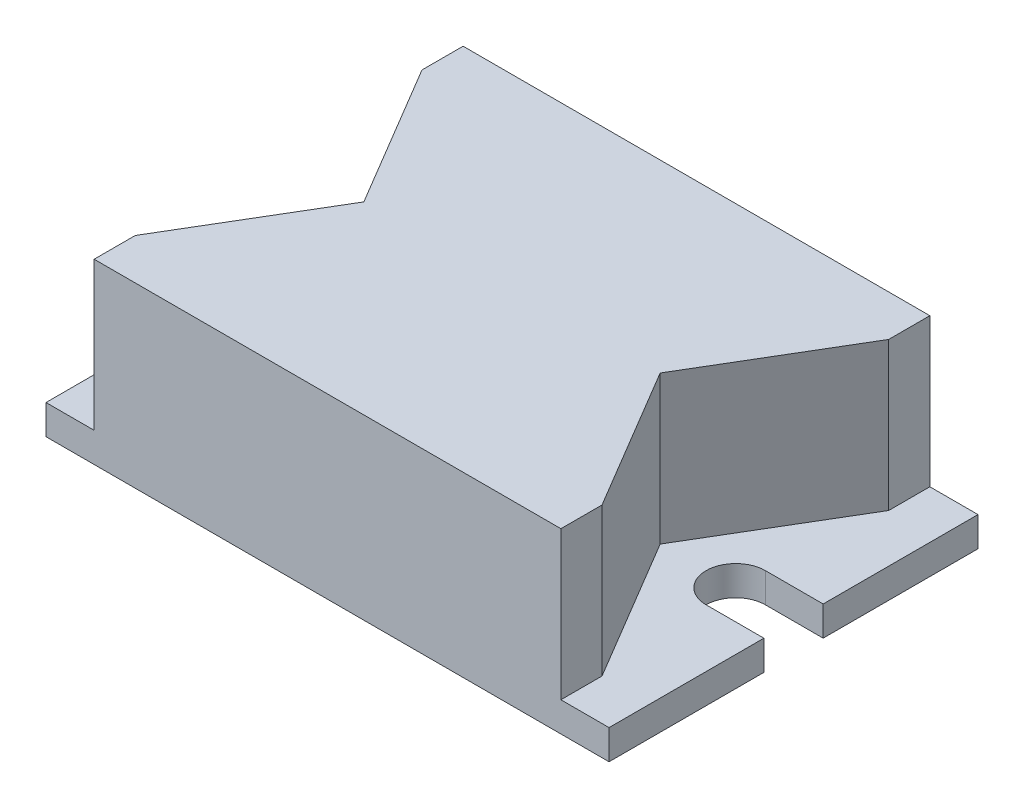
ISO-10303-21;
HEADER;
FILE_DESCRIPTION(('STEP AP214'),'2;1');
FILE_NAME('part.step','',(''),(''),'','','');
FILE_SCHEMA(('AUTOMOTIVE_DESIGN { 1 0 10303 214 1 1 1 1 }'));
ENDSEC;
DATA;
#1=APPLICATION_CONTEXT('core data for automotive mechanical design processes');
#2=APPLICATION_PROTOCOL_DEFINITION('international standard','automotive_design',2000,#1);
#3=PRODUCT_CONTEXT('',#1,'mechanical');
#4=PRODUCT('Part','Part','',(#3));
#5=PRODUCT_RELATED_PRODUCT_CATEGORY('part','',(#4));
#6=PRODUCT_DEFINITION_FORMATION('','',#4);
#7=PRODUCT_DEFINITION_CONTEXT('part definition',#1,'design');
#8=PRODUCT_DEFINITION('design','',#6,#7);
#9=PRODUCT_DEFINITION_SHAPE('','',#8);
#10=(LENGTH_UNIT() NAMED_UNIT(*) SI_UNIT(.MILLI.,.METRE.));
#11=(NAMED_UNIT(*) PLANE_ANGLE_UNIT() SI_UNIT($,.RADIAN.));
#12=(NAMED_UNIT(*) SI_UNIT($,.STERADIAN.) SOLID_ANGLE_UNIT());
#13=UNCERTAINTY_MEASURE_WITH_UNIT(LENGTH_MEASURE(1.E-05),#10,'distance_accuracy_value','');
#14=(GEOMETRIC_REPRESENTATION_CONTEXT(3) GLOBAL_UNCERTAINTY_ASSIGNED_CONTEXT((#13)) GLOBAL_UNIT_ASSIGNED_CONTEXT((#10,
#11,#12)) REPRESENTATION_CONTEXT('',''));
#15=CARTESIAN_POINT('',(0.,0.,0.));
#16=DIRECTION('',(0.,0.,1.));
#17=DIRECTION('',(1.,0.,0.));
#18=AXIS2_PLACEMENT_3D('',#15,#16,#17);
#19=CARTESIAN_POINT('',(0.,2.,0.));
#20=DIRECTION('',(0.,1.,0.));
#21=DIRECTION('',(0.,0.,1.));
#22=AXIS2_PLACEMENT_3D('',#19,#20,#21);
#23=PLANE('',#22);
#24=CARTESIAN_POINT('',(-15.1,2.,0.));
#25=DIRECTION('',(0.,1.,0.));
#26=DIRECTION('',(0.,0.,1.));
#27=AXIS2_PLACEMENT_3D('',#24,#25,#26);
#28=CIRCLE('',#27,2.);
#29=CARTESIAN_POINT('',(-15.1,2.,2.));
#30=VERTEX_POINT('',#29);
#31=EDGE_CURVE('E306',#30,#30,#28,.T.);
#32=ORIENTED_EDGE('',*,*,#31,.F.);
#33=EDGE_LOOP('',(#32));
#34=FACE_BOUND('',#33,.T.);
#35=DIRECTION('',(-0.510907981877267,0.,-0.859635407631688));
#36=VECTOR('',#35,1.);
#37=CARTESIAN_POINT('',(-7.38973034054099,2.,4.39194591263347));
#38=LINE('',#37,#36);
#39=CARTESIAN_POINT('',(-10.,2.,0.));
#40=VERTEX_POINT('',#39);
#41=CARTESIAN_POINT('',(-15.75,2.,-9.67474333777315));
#42=VERTEX_POINT('',#41);
#43=EDGE_CURVE('E63',#40,#42,#38,.T.);
#44=ORIENTED_EDGE('',*,*,#43,.T.);
#45=DIRECTION('',(0.,0.,-1.));
#46=VECTOR('',#45,1.);
#47=CARTESIAN_POINT('',(-15.75,2.,0.));
#48=LINE('',#47,#46);
#49=CARTESIAN_POINT('',(-15.75,2.,-12.45));
#50=VERTEX_POINT('',#49);
#51=EDGE_CURVE('E274',#42,#50,#48,.T.);
#52=ORIENTED_EDGE('',*,*,#51,.T.);
#53=DIRECTION('',(1.,0.,0.));
#54=VECTOR('',#53,1.);
#55=CARTESIAN_POINT('',(0.,2.,-12.45));
#56=LINE('',#55,#54);
#57=CARTESIAN_POINT('',(-19.,2.,-12.45));
#58=VERTEX_POINT('',#57);
#59=EDGE_CURVE('E280',#58,#50,#56,.T.);
#60=ORIENTED_EDGE('',*,*,#59,.F.);
#61=DIRECTION('',(0.,0.,1.));
#62=VECTOR('',#61,1.);
#63=CARTESIAN_POINT('',(-19.,2.,0.));
#64=LINE('',#63,#62);
#65=CARTESIAN_POINT('',(-19.,2.,12.45));
#66=VERTEX_POINT('',#65);
#67=EDGE_CURVE('E283',#58,#66,#64,.T.);
#68=ORIENTED_EDGE('',*,*,#67,.T.);
#69=DIRECTION('',(1.,0.,0.));
#70=VECTOR('',#69,1.);
#71=CARTESIAN_POINT('',(0.,2.,12.45));
#72=LINE('',#71,#70);
#73=CARTESIAN_POINT('',(-15.75,2.,12.45));
#74=VERTEX_POINT('',#73);
#75=EDGE_CURVE('E288',#66,#74,#72,.T.);
#76=ORIENTED_EDGE('',*,*,#75,.T.);
#77=DIRECTION('',(0.,0.,1.));
#78=VECTOR('',#77,1.);
#79=CARTESIAN_POINT('',(-15.75,2.,0.));
#80=LINE('',#79,#78);
#81=CARTESIAN_POINT('',(-15.75,2.,9.67474333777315));
#82=VERTEX_POINT('',#81);
#83=EDGE_CURVE('E266',#82,#74,#80,.T.);
#84=ORIENTED_EDGE('',*,*,#83,.F.);
#85=DIRECTION('',(-0.510907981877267,0.,0.859635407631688));
#86=VECTOR('',#85,1.);
#87=CARTESIAN_POINT('',(-7.38973034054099,2.,-4.39194591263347));
#88=LINE('',#87,#86);
#89=EDGE_CURVE('E68',#40,#82,#88,.T.);
#90=ORIENTED_EDGE('',*,*,#89,.F.);
#91=EDGE_LOOP('',(#44,#52,#60,#68,#76,#84,#90));
#92=FACE_BOUND('',#91,.T.);
#93=ADVANCED_FACE('F47',(#34,#92),#23,.T.);
#94=CARTESIAN_POINT('',(0.,2.,-12.45));
#95=DIRECTION('',(0.,0.,-1.));
#96=DIRECTION('',(-1.,0.,0.));
#97=AXIS2_PLACEMENT_3D('',#94,#95,#96);
#98=PLANE('',#97);
#99=DIRECTION('',(0.,-1.,0.));
#100=VECTOR('',#99,1.);
#101=CARTESIAN_POINT('',(19.,2.,-12.45));
#102=LINE('',#101,#100);
#103=CARTESIAN_POINT('',(19.,2.,-12.45));
#104=VERTEX_POINT('',#103);
#105=CARTESIAN_POINT('',(19.,0.,-12.45));
#106=VERTEX_POINT('',#105);
#107=EDGE_CURVE('E310',#104,#106,#102,.T.);
#108=ORIENTED_EDGE('',*,*,#107,.T.);
#109=DIRECTION('',(1.,0.,0.));
#110=VECTOR('',#109,1.);
#111=CARTESIAN_POINT('',(0.,0.,-12.45));
#112=LINE('',#111,#110);
#113=CARTESIAN_POINT('',(-19.,0.,-12.45));
#114=VERTEX_POINT('',#113);
#115=EDGE_CURVE('E279',#114,#106,#112,.T.);
#116=ORIENTED_EDGE('',*,*,#115,.F.);
#117=DIRECTION('',(0.,-1.,0.));
#118=VECTOR('',#117,1.);
#119=CARTESIAN_POINT('',(-19.,2.,-12.45));
#120=LINE('',#119,#118);
#121=EDGE_CURVE('E11',#58,#114,#120,.T.);
#122=ORIENTED_EDGE('',*,*,#121,.F.);
#123=ORIENTED_EDGE('',*,*,#59,.T.);
#124=DIRECTION('',(0.,-1.,0.));
#125=VECTOR('',#124,1.);
#126=CARTESIAN_POINT('',(-15.75,12.,-12.45));
#127=LINE('',#126,#125);
#128=CARTESIAN_POINT('',(-15.75,12.,-12.45));
#129=VERTEX_POINT('',#128);
#130=EDGE_CURVE('E182',#129,#50,#127,.T.);
#131=ORIENTED_EDGE('',*,*,#130,.F.);
#132=DIRECTION('',(1.,0.,0.));
#133=VECTOR('',#132,1.);
#134=CARTESIAN_POINT('',(0.,12.,-12.45));
#135=LINE('',#134,#133);
#136=CARTESIAN_POINT('',(15.75,12.,-12.45));
#137=VERTEX_POINT('',#136);
#138=EDGE_CURVE('E187',#129,#137,#135,.T.);
#139=ORIENTED_EDGE('',*,*,#138,.T.);
#140=DIRECTION('',(0.,-1.,0.));
#141=VECTOR('',#140,1.);
#142=CARTESIAN_POINT('',(15.75,12.,-12.45));
#143=LINE('',#142,#141);
#144=CARTESIAN_POINT('',(15.75,2.,-12.45));
#145=VERTEX_POINT('',#144);
#146=EDGE_CURVE('E171',#137,#145,#143,.T.);
#147=ORIENTED_EDGE('',*,*,#146,.T.);
#148=EDGE_CURVE('E284',#145,#104,#56,.T.);
#149=ORIENTED_EDGE('',*,*,#148,.T.);
#150=EDGE_LOOP('',(#108,#116,#122,#123,#131,#139,#147,#149));
#151=FACE_BOUND('',#150,.T.);
#152=ADVANCED_FACE('F49',(#151),#98,.T.);
#153=CARTESIAN_POINT('',(-19.,2.,0.));
#154=DIRECTION('',(1.,0.,0.));
#155=DIRECTION('',(0.,0.,-1.));
#156=AXIS2_PLACEMENT_3D('',#153,#154,#155);
#157=PLANE('',#156);
#158=DIRECTION('',(0.,0.,1.));
#159=VECTOR('',#158,1.);
#160=CARTESIAN_POINT('',(-19.,0.,0.));
#161=LINE('',#160,#159);
#162=CARTESIAN_POINT('',(-19.,0.,12.45));
#163=VERTEX_POINT('',#162);
#164=EDGE_CURVE('E313',#114,#163,#161,.T.);
#165=ORIENTED_EDGE('',*,*,#164,.T.);
#166=DIRECTION('',(0.,-1.,0.));
#167=VECTOR('',#166,1.);
#168=CARTESIAN_POINT('',(-19.,2.,12.45));
#169=LINE('',#168,#167);
#170=EDGE_CURVE('E56',#66,#163,#169,.T.);
#171=ORIENTED_EDGE('',*,*,#170,.F.);
#172=ORIENTED_EDGE('',*,*,#67,.F.);
#173=ORIENTED_EDGE('',*,*,#121,.T.);
#174=EDGE_LOOP('',(#165,#171,#172,#173));
#175=FACE_BOUND('',#174,.T.);
#176=ADVANCED_FACE('F404',(#175),#157,.F.);
#177=CARTESIAN_POINT('',(0.,2.,12.45));
#178=DIRECTION('',(0.,0.,-1.));
#179=DIRECTION('',(-1.,0.,0.));
#180=AXIS2_PLACEMENT_3D('',#177,#178,#179);
#181=PLANE('',#180);
#182=DIRECTION('',(1.,0.,0.));
#183=VECTOR('',#182,1.);
#184=CARTESIAN_POINT('',(0.,0.,12.45));
#185=LINE('',#184,#183);
#186=CARTESIAN_POINT('',(19.,0.,12.45));
#187=VERTEX_POINT('',#186);
#188=EDGE_CURVE('E316',#163,#187,#185,.T.);
#189=ORIENTED_EDGE('',*,*,#188,.T.);
#190=DIRECTION('',(0.,-1.,0.));
#191=VECTOR('',#190,1.);
#192=CARTESIAN_POINT('',(19.,2.,12.45));
#193=LINE('',#192,#191);
#194=CARTESIAN_POINT('',(19.,2.,12.45));
#195=VERTEX_POINT('',#194);
#196=EDGE_CURVE('E354',#195,#187,#193,.T.);
#197=ORIENTED_EDGE('',*,*,#196,.F.);
#198=CARTESIAN_POINT('',(15.75,2.,12.45));
#199=VERTEX_POINT('',#198);
#200=EDGE_CURVE('E287',#199,#195,#72,.T.);
#201=ORIENTED_EDGE('',*,*,#200,.F.);
#202=DIRECTION('',(0.,-1.,0.));
#203=VECTOR('',#202,1.);
#204=CARTESIAN_POINT('',(15.75,12.,12.45));
#205=LINE('',#204,#203);
#206=CARTESIAN_POINT('',(15.75,12.,12.45));
#207=VERTEX_POINT('',#206);
#208=EDGE_CURVE('E235',#207,#199,#205,.T.);
#209=ORIENTED_EDGE('',*,*,#208,.F.);
#210=DIRECTION('',(1.,0.,0.));
#211=VECTOR('',#210,1.);
#212=CARTESIAN_POINT('',(0.,12.,12.45));
#213=LINE('',#212,#211);
#214=CARTESIAN_POINT('',(-15.75,12.,12.45));
#215=VERTEX_POINT('',#214);
#216=EDGE_CURVE('E213',#215,#207,#213,.T.);
#217=ORIENTED_EDGE('',*,*,#216,.F.);
#218=DIRECTION('',(0.,-1.,0.));
#219=VECTOR('',#218,1.);
#220=CARTESIAN_POINT('',(-15.75,12.,12.45));
#221=LINE('',#220,#219);
#222=EDGE_CURVE('E239',#215,#74,#221,.T.);
#223=ORIENTED_EDGE('',*,*,#222,.T.);
#224=ORIENTED_EDGE('',*,*,#75,.F.);
#225=ORIENTED_EDGE('',*,*,#170,.T.);
#226=EDGE_LOOP('',(#189,#197,#201,#209,#217,#223,#224,#225));
#227=FACE_BOUND('',#226,.T.);
#228=ADVANCED_FACE('F363',(#227),#181,.F.);
#229=CARTESIAN_POINT('',(19.,2.,0.));
#230=DIRECTION('',(1.,0.,0.));
#231=DIRECTION('',(0.,0.,-1.));
#232=AXIS2_PLACEMENT_3D('',#229,#230,#231);
#233=PLANE('',#232);
#234=DIRECTION('',(0.,0.,1.));
#235=VECTOR('',#234,1.);
#236=CARTESIAN_POINT('',(19.,0.,0.));
#237=LINE('',#236,#235);
#238=CARTESIAN_POINT('',(19.,0.,2.));
#239=VERTEX_POINT('',#238);
#240=EDGE_CURVE('E319',#239,#187,#237,.T.);
#241=ORIENTED_EDGE('',*,*,#240,.F.);
#242=DIRECTION('',(0.,-1.,0.));
#243=VECTOR('',#242,1.);
#244=CARTESIAN_POINT('',(19.,2.,2.));
#245=LINE('',#244,#243);
#246=CARTESIAN_POINT('',(19.,2.,2.));
#247=VERTEX_POINT('',#246);
#248=EDGE_CURVE('E351',#247,#239,#245,.T.);
#249=ORIENTED_EDGE('',*,*,#248,.F.);
#250=DIRECTION('',(0.,0.,1.));
#251=VECTOR('',#250,1.);
#252=CARTESIAN_POINT('',(19.,2.,0.));
#253=LINE('',#252,#251);
#254=EDGE_CURVE('E291',#247,#195,#253,.T.);
#255=ORIENTED_EDGE('',*,*,#254,.T.);
#256=ORIENTED_EDGE('',*,*,#196,.T.);
#257=EDGE_LOOP('',(#241,#249,#255,#256));
#258=FACE_BOUND('',#257,.T.);
#259=ADVANCED_FACE('F376',(#258),#233,.T.);
#260=CARTESIAN_POINT('',(0.,2.,2.));
#261=DIRECTION('',(0.,0.,-1.));
#262=DIRECTION('',(-1.,0.,0.));
#263=AXIS2_PLACEMENT_3D('',#260,#261,#262);
#264=PLANE('',#263);
#265=DIRECTION('',(1.,0.,0.));
#266=VECTOR('',#265,1.);
#267=CARTESIAN_POINT('',(0.,0.,2.));
#268=LINE('',#267,#266);
#269=CARTESIAN_POINT('',(15.1,0.,2.));
#270=VERTEX_POINT('',#269);
#271=EDGE_CURVE('E323',#270,#239,#268,.T.);
#272=ORIENTED_EDGE('',*,*,#271,.F.);
#273=DIRECTION('',(0.,-1.,0.));
#274=VECTOR('',#273,1.);
#275=CARTESIAN_POINT('',(15.1,2.,2.));
#276=LINE('',#275,#274);
#277=CARTESIAN_POINT('',(15.1,2.,2.));
#278=VERTEX_POINT('',#277);
#279=EDGE_CURVE('E348',#278,#270,#276,.T.);
#280=ORIENTED_EDGE('',*,*,#279,.F.);
#281=DIRECTION('',(1.,0.,0.));
#282=VECTOR('',#281,1.);
#283=CARTESIAN_POINT('',(0.,2.,2.));
#284=LINE('',#283,#282);
#285=EDGE_CURVE('E295',#278,#247,#284,.T.);
#286=ORIENTED_EDGE('',*,*,#285,.T.);
#287=ORIENTED_EDGE('',*,*,#248,.T.);
#288=EDGE_LOOP('',(#272,#280,#286,#287));
#289=FACE_BOUND('',#288,.T.);
#290=ADVANCED_FACE('F556',(#289),#264,.T.);
#291=CARTESIAN_POINT('',(15.1,2.,0.));
#292=DIRECTION('',(0.,-1.,0.));
#293=DIRECTION('',(0.,0.,-1.));
#294=AXIS2_PLACEMENT_3D('',#291,#292,#293);
#295=CYLINDRICAL_SURFACE('',#294,2.);
#296=CARTESIAN_POINT('',(15.1,0.,0.));
#297=DIRECTION('',(0.,1.,0.));
#298=DIRECTION('',(0.,0.,1.));
#299=AXIS2_PLACEMENT_3D('',#296,#297,#298);
#300=CIRCLE('',#299,2.);
#301=CARTESIAN_POINT('',(15.1,0.,-2.));
#302=VERTEX_POINT('',#301);
#303=EDGE_CURVE('E328',#270,#302,#300,.F.);
#304=ORIENTED_EDGE('',*,*,#303,.T.);
#305=DIRECTION('',(0.,-1.,0.));
#306=VECTOR('',#305,1.);
#307=CARTESIAN_POINT('',(15.1,2.,-2.));
#308=LINE('',#307,#306);
#309=CARTESIAN_POINT('',(15.1,2.,-2.));
#310=VERTEX_POINT('',#309);
#311=EDGE_CURVE('E344',#310,#302,#308,.T.);
#312=ORIENTED_EDGE('',*,*,#311,.F.);
#313=CARTESIAN_POINT('',(15.1,2.,0.));
#314=DIRECTION('',(0.,1.,0.));
#315=DIRECTION('',(0.,0.,1.));
#316=AXIS2_PLACEMENT_3D('',#313,#314,#315);
#317=CIRCLE('',#316,2.);
#318=EDGE_CURVE('E300',#278,#310,#317,.F.);
#319=ORIENTED_EDGE('',*,*,#318,.F.);
#320=ORIENTED_EDGE('',*,*,#279,.T.);
#321=EDGE_LOOP('',(#304,#312,#319,#320));
#322=FACE_BOUND('',#321,.T.);
#323=ADVANCED_FACE('F547',(#322),#295,.F.);
#324=CARTESIAN_POINT('',(0.,2.,-2.));
#325=DIRECTION('',(0.,0.,-1.));
#326=DIRECTION('',(-1.,0.,0.));
#327=AXIS2_PLACEMENT_3D('',#324,#325,#326);
#328=PLANE('',#327);
#329=DIRECTION('',(1.,0.,0.));
#330=VECTOR('',#329,1.);
#331=CARTESIAN_POINT('',(0.,0.,-2.));
#332=LINE('',#331,#330);
#333=CARTESIAN_POINT('',(19.,0.,-2.));
#334=VERTEX_POINT('',#333);
#335=EDGE_CURVE('E331',#302,#334,#332,.T.);
#336=ORIENTED_EDGE('',*,*,#335,.T.);
#337=DIRECTION('',(0.,-1.,0.));
#338=VECTOR('',#337,1.);
#339=CARTESIAN_POINT('',(19.,2.,-2.));
#340=LINE('',#339,#338);
#341=CARTESIAN_POINT('',(19.,2.,-2.));
#342=VERTEX_POINT('',#341);
#343=EDGE_CURVE('E341',#342,#334,#340,.T.);
#344=ORIENTED_EDGE('',*,*,#343,.F.);
#345=DIRECTION('',(1.,0.,0.));
#346=VECTOR('',#345,1.);
#347=CARTESIAN_POINT('',(0.,2.,-2.));
#348=LINE('',#347,#346);
#349=EDGE_CURVE('E303',#310,#342,#348,.T.);
#350=ORIENTED_EDGE('',*,*,#349,.F.);
#351=ORIENTED_EDGE('',*,*,#311,.T.);
#352=EDGE_LOOP('',(#336,#344,#350,#351));
#353=FACE_BOUND('',#352,.T.);
#354=ADVANCED_FACE('F538',(#353),#328,.F.);
#355=EDGE_CURVE('E324',#106,#334,#237,.T.);
#356=ORIENTED_EDGE('',*,*,#355,.F.);
#357=ORIENTED_EDGE('',*,*,#107,.F.);
#358=EDGE_CURVE('E296',#104,#342,#253,.T.);
#359=ORIENTED_EDGE('',*,*,#358,.T.);
#360=ORIENTED_EDGE('',*,*,#343,.T.);
#361=EDGE_LOOP('',(#356,#357,#359,#360));
#362=FACE_BOUND('',#361,.T.);
#363=ADVANCED_FACE('F427',(#362),#233,.T.);
#364=CARTESIAN_POINT('',(-15.1,2.,0.));
#365=DIRECTION('',(0.,-1.,0.));
#366=DIRECTION('',(0.,0.,-1.));
#367=AXIS2_PLACEMENT_3D('',#364,#365,#366);
#368=CYLINDRICAL_SURFACE('',#367,2.);
#369=ORIENTED_EDGE('',*,*,#31,.T.);
#370=EDGE_LOOP('',(#369));
#371=FACE_BOUND('',#370,.T.);
#372=CARTESIAN_POINT('',(-15.1,0.,0.));
#373=DIRECTION('',(0.,1.,0.));
#374=DIRECTION('',(0.,0.,1.));
#375=AXIS2_PLACEMENT_3D('',#372,#373,#374);
#376=CIRCLE('',#375,2.);
#377=CARTESIAN_POINT('',(-15.1,0.,2.));
#378=VERTEX_POINT('',#377);
#379=EDGE_CURVE('E335',#378,#378,#376,.T.);
#380=ORIENTED_EDGE('',*,*,#379,.F.);
#381=EDGE_LOOP('',(#380));
#382=FACE_BOUND('',#381,.T.);
#383=ADVANCED_FACE('F423',(#371,#382),#368,.F.);
#384=DIRECTION('',(0.,0.,-1.));
#385=VECTOR('',#384,1.);
#386=CARTESIAN_POINT('',(15.75,2.,0.));
#387=LINE('',#386,#385);
#388=CARTESIAN_POINT('',(15.75,2.,-9.67474333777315));
#389=VERTEX_POINT('',#388);
#390=EDGE_CURVE('E177',#389,#145,#387,.T.);
#391=ORIENTED_EDGE('',*,*,#390,.F.);
#392=DIRECTION('',(0.510907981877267,0.,-0.859635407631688));
#393=VECTOR('',#392,1.);
#394=CARTESIAN_POINT('',(7.38973034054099,2.,4.39194591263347));
#395=LINE('',#394,#393);
#396=CARTESIAN_POINT('',(10.,2.,0.));
#397=VERTEX_POINT('',#396);
#398=EDGE_CURVE('E181',#397,#389,#395,.T.);
#399=ORIENTED_EDGE('',*,*,#398,.F.);
#400=DIRECTION('',(0.510907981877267,0.,0.859635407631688));
#401=VECTOR('',#400,1.);
#402=CARTESIAN_POINT('',(7.38973034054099,2.,-4.39194591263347));
#403=LINE('',#402,#401);
#404=CARTESIAN_POINT('',(15.75,2.,9.67474333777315));
#405=VERTEX_POINT('',#404);
#406=EDGE_CURVE('E260',#397,#405,#403,.T.);
#407=ORIENTED_EDGE('',*,*,#406,.T.);
#408=DIRECTION('',(0.,0.,1.));
#409=VECTOR('',#408,1.);
#410=CARTESIAN_POINT('',(15.75,2.,0.));
#411=LINE('',#410,#409);
#412=EDGE_CURVE('E263',#405,#199,#411,.T.);
#413=ORIENTED_EDGE('',*,*,#412,.T.);
#414=ORIENTED_EDGE('',*,*,#200,.T.);
#415=ORIENTED_EDGE('',*,*,#254,.F.);
#416=ORIENTED_EDGE('',*,*,#285,.F.);
#417=ORIENTED_EDGE('',*,*,#318,.T.);
#418=ORIENTED_EDGE('',*,*,#349,.T.);
#419=ORIENTED_EDGE('',*,*,#358,.F.);
#420=ORIENTED_EDGE('',*,*,#148,.F.);
#421=EDGE_LOOP('',(#391,#399,#407,#413,#414,#415,#416,#417,#418,#419,#420));
#422=FACE_BOUND('',#421,.T.);
#423=ADVANCED_FACE('F415',(#422),#23,.T.);
#424=CARTESIAN_POINT('',(0.,0.,0.));
#425=DIRECTION('',(0.,1.,0.));
#426=DIRECTION('',(0.,0.,1.));
#427=AXIS2_PLACEMENT_3D('',#424,#425,#426);
#428=PLANE('',#427);
#429=ORIENTED_EDGE('',*,*,#115,.T.);
#430=ORIENTED_EDGE('',*,*,#355,.T.);
#431=ORIENTED_EDGE('',*,*,#335,.F.);
#432=ORIENTED_EDGE('',*,*,#303,.F.);
#433=ORIENTED_EDGE('',*,*,#271,.T.);
#434=ORIENTED_EDGE('',*,*,#240,.T.);
#435=ORIENTED_EDGE('',*,*,#188,.F.);
#436=ORIENTED_EDGE('',*,*,#164,.F.);
#437=EDGE_LOOP('',(#429,#430,#431,#432,#433,#434,#435,#436));
#438=FACE_BOUND('',#437,.T.);
#439=ORIENTED_EDGE('',*,*,#379,.T.);
#440=EDGE_LOOP('',(#439));
#441=FACE_BOUND('',#440,.T.);
#442=ADVANCED_FACE('F369',(#438,#441),#428,.F.);
#443=CARTESIAN_POINT('',(15.75,12.,0.));
#444=DIRECTION('',(1.,0.,0.));
#445=DIRECTION('',(0.,0.,-1.));
#446=AXIS2_PLACEMENT_3D('',#443,#444,#445);
#447=PLANE('',#446);
#448=DIRECTION('',(0.,-1.,0.));
#449=VECTOR('',#448,1.);
#450=CARTESIAN_POINT('',(15.75,12.,-9.67474333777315));
#451=LINE('',#450,#449);
#452=CARTESIAN_POINT('',(15.75,12.,-9.67474333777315));
#453=VERTEX_POINT('',#452);
#454=EDGE_CURVE('E224',#453,#389,#451,.T.);
#455=ORIENTED_EDGE('',*,*,#454,.T.);
#456=ORIENTED_EDGE('',*,*,#390,.T.);
#457=ORIENTED_EDGE('',*,*,#146,.F.);
#458=DIRECTION('',(0.,0.,1.));
#459=VECTOR('',#458,1.);
#460=CARTESIAN_POINT('',(15.75,12.,0.));
#461=LINE('',#460,#459);
#462=EDGE_CURVE('E175',#137,#453,#461,.T.);
#463=ORIENTED_EDGE('',*,*,#462,.T.);
#464=EDGE_LOOP('',(#455,#456,#457,#463));
#465=FACE_BOUND('',#464,.T.);
#466=ADVANCED_FACE('F174',(#465),#447,.T.);
#467=CARTESIAN_POINT('',(-15.75,12.,0.));
#468=DIRECTION('',(1.,0.,0.));
#469=DIRECTION('',(0.,0.,-1.));
#470=AXIS2_PLACEMENT_3D('',#467,#468,#469);
#471=PLANE('',#470);
#472=ORIENTED_EDGE('',*,*,#51,.F.);
#473=DIRECTION('',(0.,-1.,0.));
#474=VECTOR('',#473,1.);
#475=CARTESIAN_POINT('',(-15.75,12.,-9.67474333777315));
#476=LINE('',#475,#474);
#477=CARTESIAN_POINT('',(-15.75,12.,-9.67474333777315));
#478=VERTEX_POINT('',#477);
#479=EDGE_CURVE('E251',#478,#42,#476,.T.);
#480=ORIENTED_EDGE('',*,*,#479,.F.);
#481=DIRECTION('',(0.,0.,1.));
#482=VECTOR('',#481,1.);
#483=CARTESIAN_POINT('',(-15.75,12.,0.));
#484=LINE('',#483,#482);
#485=EDGE_CURVE('E197',#129,#478,#484,.T.);
#486=ORIENTED_EDGE('',*,*,#485,.F.);
#487=ORIENTED_EDGE('',*,*,#130,.T.);
#488=EDGE_LOOP('',(#472,#480,#486,#487));
#489=FACE_BOUND('',#488,.T.);
#490=ADVANCED_FACE('F402',(#489),#471,.F.);
#491=CARTESIAN_POINT('',(-7.38973034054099,12.,4.39194591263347));
#492=DIRECTION('',(0.859635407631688,0.,-0.510907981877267));
#493=DIRECTION('',(-0.510907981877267,0.,-0.859635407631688));
#494=AXIS2_PLACEMENT_3D('',#491,#492,#493);
#495=PLANE('',#494);
#496=ORIENTED_EDGE('',*,*,#43,.F.);
#497=DIRECTION('',(0.,-1.,0.));
#498=VECTOR('',#497,1.);
#499=CARTESIAN_POINT('',(-10.,12.,0.));
#500=LINE('',#499,#498);
#501=CARTESIAN_POINT('',(-10.,12.,0.));
#502=VERTEX_POINT('',#501);
#503=EDGE_CURVE('E247',#502,#40,#500,.T.);
#504=ORIENTED_EDGE('',*,*,#503,.F.);
#505=DIRECTION('',(0.510907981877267,0.,0.859635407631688));
#506=VECTOR('',#505,1.);
#507=CARTESIAN_POINT('',(-7.38973034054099,12.,4.39194591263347));
#508=LINE('',#507,#506);
#509=EDGE_CURVE('E200',#478,#502,#508,.T.);
#510=ORIENTED_EDGE('',*,*,#509,.F.);
#511=ORIENTED_EDGE('',*,*,#479,.T.);
#512=EDGE_LOOP('',(#496,#504,#510,#511));
#513=FACE_BOUND('',#512,.T.);
#514=ADVANCED_FACE('F399',(#513),#495,.F.);
#515=CARTESIAN_POINT('',(-7.38973034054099,12.,-4.39194591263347));
#516=DIRECTION('',(-0.859635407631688,0.,-0.510907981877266));
#517=DIRECTION('',(-0.510907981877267,0.,0.859635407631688));
#518=AXIS2_PLACEMENT_3D('',#515,#516,#517);
#519=PLANE('',#518);
#520=ORIENTED_EDGE('',*,*,#503,.T.);
#521=ORIENTED_EDGE('',*,*,#89,.T.);
#522=DIRECTION('',(0.,-1.,0.));
#523=VECTOR('',#522,1.);
#524=CARTESIAN_POINT('',(-15.75,12.,9.67474333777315));
#525=LINE('',#524,#523);
#526=CARTESIAN_POINT('',(-15.75,12.,9.67474333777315));
#527=VERTEX_POINT('',#526);
#528=EDGE_CURVE('E243',#527,#82,#525,.T.);
#529=ORIENTED_EDGE('',*,*,#528,.F.);
#530=DIRECTION('',(0.510907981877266,0.,-0.859635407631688));
#531=VECTOR('',#530,1.);
#532=CARTESIAN_POINT('',(-7.38973034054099,12.,-4.39194591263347));
#533=LINE('',#532,#531);
#534=EDGE_CURVE('E205',#527,#502,#533,.T.);
#535=ORIENTED_EDGE('',*,*,#534,.T.);
#536=EDGE_LOOP('',(#520,#521,#529,#535));
#537=FACE_BOUND('',#536,.T.);
#538=ADVANCED_FACE('F395',(#537),#519,.T.);
#539=CARTESIAN_POINT('',(-15.75,12.,0.));
#540=DIRECTION('',(-1.,0.,0.));
#541=DIRECTION('',(0.,0.,1.));
#542=AXIS2_PLACEMENT_3D('',#539,#540,#541);
#543=PLANE('',#542);
#544=ORIENTED_EDGE('',*,*,#528,.T.);
#545=ORIENTED_EDGE('',*,*,#83,.T.);
#546=ORIENTED_EDGE('',*,*,#222,.F.);
#547=DIRECTION('',(0.,0.,-1.));
#548=VECTOR('',#547,1.);
#549=CARTESIAN_POINT('',(-15.75,12.,0.));
#550=LINE('',#549,#548);
#551=EDGE_CURVE('E209',#215,#527,#550,.T.);
#552=ORIENTED_EDGE('',*,*,#551,.T.);
#553=EDGE_LOOP('',(#544,#545,#546,#552));
#554=FACE_BOUND('',#553,.T.);
#555=ADVANCED_FACE('F393',(#554),#543,.T.);
#556=CARTESIAN_POINT('',(15.75,12.,0.));
#557=DIRECTION('',(-1.,0.,0.));
#558=DIRECTION('',(0.,0.,1.));
#559=AXIS2_PLACEMENT_3D('',#556,#557,#558);
#560=PLANE('',#559);
#561=ORIENTED_EDGE('',*,*,#412,.F.);
#562=DIRECTION('',(0.,-1.,0.));
#563=VECTOR('',#562,1.);
#564=CARTESIAN_POINT('',(15.75,12.,9.67474333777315));
#565=LINE('',#564,#563);
#566=CARTESIAN_POINT('',(15.75,12.,9.67474333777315));
#567=VERTEX_POINT('',#566);
#568=EDGE_CURVE('E231',#567,#405,#565,.T.);
#569=ORIENTED_EDGE('',*,*,#568,.F.);
#570=DIRECTION('',(0.,0.,-1.));
#571=VECTOR('',#570,1.);
#572=CARTESIAN_POINT('',(15.75,12.,0.));
#573=LINE('',#572,#571);
#574=EDGE_CURVE('E216',#207,#567,#573,.T.);
#575=ORIENTED_EDGE('',*,*,#574,.F.);
#576=ORIENTED_EDGE('',*,*,#208,.T.);
#577=EDGE_LOOP('',(#561,#569,#575,#576));
#578=FACE_BOUND('',#577,.T.);
#579=ADVANCED_FACE('F386',(#578),#560,.F.);
#580=CARTESIAN_POINT('',(7.38973034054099,12.,-4.39194591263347));
#581=DIRECTION('',(-0.859635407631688,0.,0.510907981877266));
#582=DIRECTION('',(0.510907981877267,0.,0.859635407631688));
#583=AXIS2_PLACEMENT_3D('',#580,#581,#582);
#584=PLANE('',#583);
#585=ORIENTED_EDGE('',*,*,#406,.F.);
#586=DIRECTION('',(0.,-1.,0.));
#587=VECTOR('',#586,1.);
#588=CARTESIAN_POINT('',(10.,12.,0.));
#589=LINE('',#588,#587);
#590=CARTESIAN_POINT('',(10.,12.,0.));
#591=VERTEX_POINT('',#590);
#592=EDGE_CURVE('E227',#591,#397,#589,.T.);
#593=ORIENTED_EDGE('',*,*,#592,.F.);
#594=DIRECTION('',(-0.510907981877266,0.,-0.859635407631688));
#595=VECTOR('',#594,1.);
#596=CARTESIAN_POINT('',(7.38973034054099,12.,-4.39194591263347));
#597=LINE('',#596,#595);
#598=EDGE_CURVE('E219',#567,#591,#597,.T.);
#599=ORIENTED_EDGE('',*,*,#598,.F.);
#600=ORIENTED_EDGE('',*,*,#568,.T.);
#601=EDGE_LOOP('',(#585,#593,#599,#600));
#602=FACE_BOUND('',#601,.T.);
#603=ADVANCED_FACE('F435',(#602),#584,.F.);
#604=CARTESIAN_POINT('',(7.38973034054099,12.,4.39194591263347));
#605=DIRECTION('',(0.859635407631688,0.,0.510907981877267));
#606=DIRECTION('',(0.510907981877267,0.,-0.859635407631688));
#607=AXIS2_PLACEMENT_3D('',#604,#605,#606);
#608=PLANE('',#607);
#609=ORIENTED_EDGE('',*,*,#592,.T.);
#610=ORIENTED_EDGE('',*,*,#398,.T.);
#611=ORIENTED_EDGE('',*,*,#454,.F.);
#612=DIRECTION('',(-0.510907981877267,0.,0.859635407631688));
#613=VECTOR('',#612,1.);
#614=CARTESIAN_POINT('',(7.38973034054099,12.,4.39194591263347));
#615=LINE('',#614,#613);
#616=EDGE_CURVE('E189',#453,#591,#615,.T.);
#617=ORIENTED_EDGE('',*,*,#616,.T.);
#618=EDGE_LOOP('',(#609,#610,#611,#617));
#619=FACE_BOUND('',#618,.T.);
#620=ADVANCED_FACE('F433',(#619),#608,.T.);
#621=CARTESIAN_POINT('',(0.,12.,0.));
#622=DIRECTION('',(0.,1.,0.));
#623=DIRECTION('',(0.,0.,1.));
#624=AXIS2_PLACEMENT_3D('',#621,#622,#623);
#625=PLANE('',#624);
#626=ORIENTED_EDGE('',*,*,#462,.F.);
#627=ORIENTED_EDGE('',*,*,#138,.F.);
#628=ORIENTED_EDGE('',*,*,#485,.T.);
#629=ORIENTED_EDGE('',*,*,#509,.T.);
#630=ORIENTED_EDGE('',*,*,#534,.F.);
#631=ORIENTED_EDGE('',*,*,#551,.F.);
#632=ORIENTED_EDGE('',*,*,#216,.T.);
#633=ORIENTED_EDGE('',*,*,#574,.T.);
#634=ORIENTED_EDGE('',*,*,#598,.T.);
#635=ORIENTED_EDGE('',*,*,#616,.F.);
#636=EDGE_LOOP('',(#626,#627,#628,#629,#630,#631,#632,#633,#634,#635));
#637=FACE_BOUND('',#636,.T.);
#638=ADVANCED_FACE('F186',(#637),#625,.T.);
#639=CLOSED_SHELL('',(#93,#152,#176,#228,#259,#290,#323,#354,#363,#383,#423,#442,#466,#490,#514,
#538,#555,#579,#603,#620,#638));
#640=MANIFOLD_SOLID_BREP('B2',#639);
#641=ADVANCED_BREP_SHAPE_REPRESENTATION('',(#18,#640),#14);
#642=SHAPE_DEFINITION_REPRESENTATION(#9,#641);
ENDSEC;
END-ISO-10303-21;
